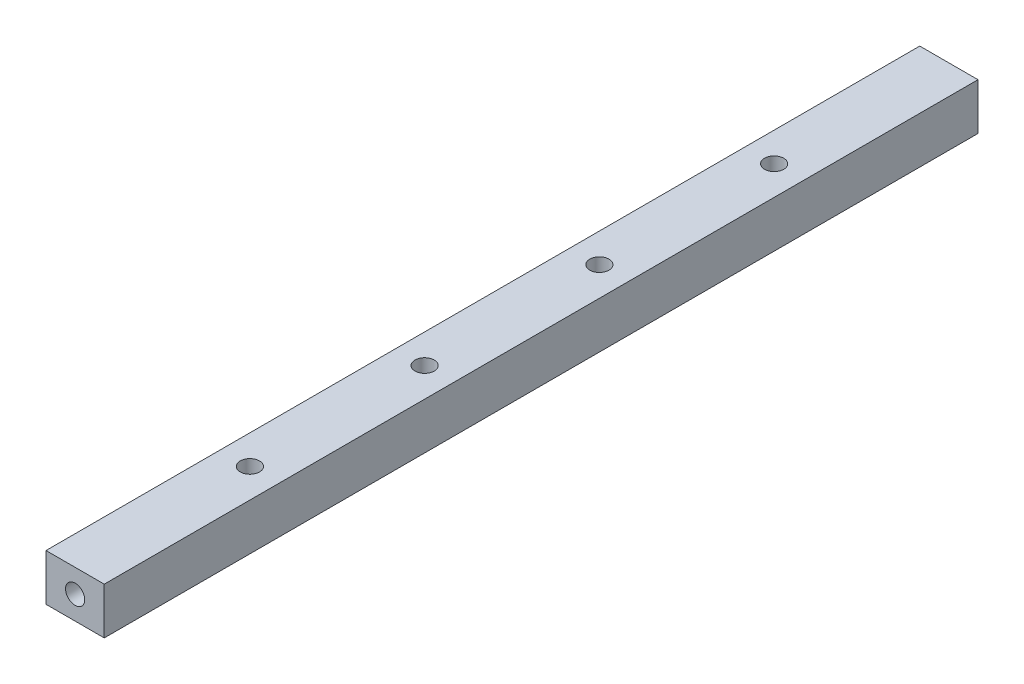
ISO-10303-21;
HEADER;
FILE_DESCRIPTION(('STEP AP214'),'2;1');
FILE_NAME('part.step','',(''),(''),'','','');
FILE_SCHEMA(('AUTOMOTIVE_DESIGN { 1 0 10303 214 1 1 1 1 }'));
ENDSEC;
DATA;
#1=APPLICATION_CONTEXT('core data for automotive mechanical design processes');
#2=APPLICATION_PROTOCOL_DEFINITION('international standard','automotive_design',2000,#1);
#3=PRODUCT_CONTEXT('',#1,'mechanical');
#4=PRODUCT('Part','Part','',(#3));
#5=PRODUCT_RELATED_PRODUCT_CATEGORY('part','',(#4));
#6=PRODUCT_DEFINITION_FORMATION('','',#4);
#7=PRODUCT_DEFINITION_CONTEXT('part definition',#1,'design');
#8=PRODUCT_DEFINITION('design','',#6,#7);
#9=PRODUCT_DEFINITION_SHAPE('','',#8);
#10=(LENGTH_UNIT() NAMED_UNIT(*) SI_UNIT(.MILLI.,.METRE.));
#11=(NAMED_UNIT(*) PLANE_ANGLE_UNIT() SI_UNIT($,.RADIAN.));
#12=(NAMED_UNIT(*) SI_UNIT($,.STERADIAN.) SOLID_ANGLE_UNIT());
#13=UNCERTAINTY_MEASURE_WITH_UNIT(LENGTH_MEASURE(1.E-05),#10,'distance_accuracy_value','');
#14=(GEOMETRIC_REPRESENTATION_CONTEXT(3) GLOBAL_UNCERTAINTY_ASSIGNED_CONTEXT((#13)) GLOBAL_UNIT_ASSIGNED_CONTEXT((#10,
#11,#12)) REPRESENTATION_CONTEXT('',''));
#15=CARTESIAN_POINT('',(0.,0.,0.));
#16=DIRECTION('',(0.,0.,1.));
#17=DIRECTION('',(1.,0.,0.));
#18=AXIS2_PLACEMENT_3D('',#15,#16,#17);
#19=CARTESIAN_POINT('',(-5.,4.,150.));
#20=DIRECTION('',(1.,0.,0.));
#21=DIRECTION('',(0.,0.,-1.));
#22=AXIS2_PLACEMENT_3D('',#19,#20,#21);
#23=PLANE('',#22);
#24=DIRECTION('',(0.,-1.,0.));
#25=VECTOR('',#24,1.);
#26=CARTESIAN_POINT('',(-5.,4.,0.));
#27=LINE('',#26,#25);
#28=CARTESIAN_POINT('',(-5.,4.,0.));
#29=VERTEX_POINT('',#28);
#30=CARTESIAN_POINT('',(-5.,-4.,0.));
#31=VERTEX_POINT('',#30);
#32=EDGE_CURVE('E95',#29,#31,#27,.T.);
#33=ORIENTED_EDGE('',*,*,#32,.T.);
#34=DIRECTION('',(0.,0.,-1.));
#35=VECTOR('',#34,1.);
#36=CARTESIAN_POINT('',(-5.,-4.,150.));
#37=LINE('',#36,#35);
#38=CARTESIAN_POINT('',(-5.,-4.,150.));
#39=VERTEX_POINT('',#38);
#40=EDGE_CURVE('E121',#39,#31,#37,.T.);
#41=ORIENTED_EDGE('',*,*,#40,.F.);
#42=DIRECTION('',(0.,-1.,0.));
#43=VECTOR('',#42,1.);
#44=CARTESIAN_POINT('',(-5.,4.,150.));
#45=LINE('',#44,#43);
#46=CARTESIAN_POINT('',(-5.,4.,150.));
#47=VERTEX_POINT('',#46);
#48=EDGE_CURVE('E106',#47,#39,#45,.T.);
#49=ORIENTED_EDGE('',*,*,#48,.F.);
#50=DIRECTION('',(0.,0.,-1.));
#51=VECTOR('',#50,1.);
#52=CARTESIAN_POINT('',(-5.,4.,150.));
#53=LINE('',#52,#51);
#54=EDGE_CURVE('E111',#47,#29,#53,.T.);
#55=ORIENTED_EDGE('',*,*,#54,.T.);
#56=EDGE_LOOP('',(#33,#41,#49,#55));
#57=FACE_BOUND('',#56,.T.);
#58=ADVANCED_FACE('F32',(#57),#23,.F.);
#59=CARTESIAN_POINT('',(-5.,-4.,150.));
#60=DIRECTION('',(0.,1.,0.));
#61=DIRECTION('',(0.,0.,1.));
#62=AXIS2_PLACEMENT_3D('',#59,#60,#61);
#63=PLANE('',#62);
#64=CARTESIAN_POINT('',(0.,-4.,60.));
#65=DIRECTION('',(0.,1.,0.));
#66=DIRECTION('',(0.,0.,1.));
#67=AXIS2_PLACEMENT_3D('',#64,#65,#66);
#68=CIRCLE('',#67,1.65);
#69=CARTESIAN_POINT('',(0.,-4.,61.65));
#70=VERTEX_POINT('',#69);
#71=EDGE_CURVE('E258',#70,#70,#68,.T.);
#72=ORIENTED_EDGE('',*,*,#71,.T.);
#73=EDGE_LOOP('',(#72));
#74=FACE_BOUND('',#73,.T.);
#75=CARTESIAN_POINT('',(0.,-4.,30.));
#76=DIRECTION('',(0.,1.,0.));
#77=DIRECTION('',(0.,0.,1.));
#78=AXIS2_PLACEMENT_3D('',#75,#76,#77);
#79=CIRCLE('',#78,1.65);
#80=CARTESIAN_POINT('',(0.,-4.,31.65));
#81=VERTEX_POINT('',#80);
#82=EDGE_CURVE('E102',#81,#81,#79,.T.);
#83=ORIENTED_EDGE('',*,*,#82,.T.);
#84=EDGE_LOOP('',(#83));
#85=FACE_BOUND('',#84,.T.);
#86=DIRECTION('',(1.,0.,0.));
#87=VECTOR('',#86,1.);
#88=CARTESIAN_POINT('',(-5.,-4.,0.));
#89=LINE('',#88,#87);
#90=CARTESIAN_POINT('',(5.,-4.,0.));
#91=VERTEX_POINT('',#90);
#92=EDGE_CURVE('E99',#31,#91,#89,.T.);
#93=ORIENTED_EDGE('',*,*,#92,.T.);
#94=DIRECTION('',(0.,0.,-1.));
#95=VECTOR('',#94,1.);
#96=CARTESIAN_POINT('',(5.,-4.,150.));
#97=LINE('',#96,#95);
#98=CARTESIAN_POINT('',(5.,-4.,150.));
#99=VERTEX_POINT('',#98);
#100=EDGE_CURVE('E119',#99,#91,#97,.T.);
#101=ORIENTED_EDGE('',*,*,#100,.F.);
#102=DIRECTION('',(1.,0.,0.));
#103=VECTOR('',#102,1.);
#104=CARTESIAN_POINT('',(-5.,-4.,150.));
#105=LINE('',#104,#103);
#106=EDGE_CURVE('E81',#39,#99,#105,.T.);
#107=ORIENTED_EDGE('',*,*,#106,.F.);
#108=ORIENTED_EDGE('',*,*,#40,.T.);
#109=EDGE_LOOP('',(#93,#101,#107,#108));
#110=FACE_BOUND('',#109,.T.);
#111=CARTESIAN_POINT('',(0.,-4.,90.));
#112=DIRECTION('',(0.,1.,0.));
#113=DIRECTION('',(0.,0.,1.));
#114=AXIS2_PLACEMENT_3D('',#111,#112,#113);
#115=CIRCLE('',#114,1.65);
#116=CARTESIAN_POINT('',(0.,-4.,91.65));
#117=VERTEX_POINT('',#116);
#118=EDGE_CURVE('E123',#117,#117,#115,.T.);
#119=ORIENTED_EDGE('',*,*,#118,.T.);
#120=EDGE_LOOP('',(#119));
#121=FACE_BOUND('',#120,.T.);
#122=CARTESIAN_POINT('',(0.,-4.,120.));
#123=DIRECTION('',(0.,1.,0.));
#124=DIRECTION('',(0.,0.,1.));
#125=AXIS2_PLACEMENT_3D('',#122,#123,#124);
#126=CIRCLE('',#125,1.65);
#127=CARTESIAN_POINT('',(0.,-4.,121.65));
#128=VERTEX_POINT('',#127);
#129=EDGE_CURVE('E41',#128,#128,#126,.T.);
#130=ORIENTED_EDGE('',*,*,#129,.T.);
#131=EDGE_LOOP('',(#130));
#132=FACE_BOUND('',#131,.T.);
#133=ADVANCED_FACE('F131',(#74,#85,#110,#121,#132),#63,.F.);
#134=CARTESIAN_POINT('',(5.,4.,150.));
#135=DIRECTION('',(-1.,0.,0.));
#136=DIRECTION('',(0.,-1.,0.));
#137=AXIS2_PLACEMENT_3D('',#134,#135,#136);
#138=PLANE('',#137);
#139=DIRECTION('',(0.,1.,0.));
#140=VECTOR('',#139,1.);
#141=CARTESIAN_POINT('',(5.,4.,0.));
#142=LINE('',#141,#140);
#143=CARTESIAN_POINT('',(5.,4.,0.));
#144=VERTEX_POINT('',#143);
#145=EDGE_CURVE('E67',#91,#144,#142,.T.);
#146=ORIENTED_EDGE('',*,*,#145,.T.);
#147=DIRECTION('',(0.,0.,-1.));
#148=VECTOR('',#147,1.);
#149=CARTESIAN_POINT('',(5.,4.,150.));
#150=LINE('',#149,#148);
#151=CARTESIAN_POINT('',(5.,4.,150.));
#152=VERTEX_POINT('',#151);
#153=EDGE_CURVE('E117',#152,#144,#150,.T.);
#154=ORIENTED_EDGE('',*,*,#153,.F.);
#155=DIRECTION('',(0.,1.,0.));
#156=VECTOR('',#155,1.);
#157=CARTESIAN_POINT('',(5.,4.,150.));
#158=LINE('',#157,#156);
#159=EDGE_CURVE('E109',#99,#152,#158,.T.);
#160=ORIENTED_EDGE('',*,*,#159,.F.);
#161=ORIENTED_EDGE('',*,*,#100,.T.);
#162=EDGE_LOOP('',(#146,#154,#160,#161));
#163=FACE_BOUND('',#162,.T.);
#164=ADVANCED_FACE('F141',(#163),#138,.F.);
#165=CARTESIAN_POINT('',(-5.,4.,150.));
#166=DIRECTION('',(0.,-1.,0.));
#167=DIRECTION('',(0.,0.,-1.));
#168=AXIS2_PLACEMENT_3D('',#165,#166,#167);
#169=PLANE('',#168);
#170=CARTESIAN_POINT('',(0.,4.,60.));
#171=DIRECTION('',(0.,1.,0.));
#172=DIRECTION('',(0.,0.,1.));
#173=AXIS2_PLACEMENT_3D('',#170,#171,#172);
#174=CIRCLE('',#173,1.64999999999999);
#175=CARTESIAN_POINT('',(0.,4.,61.65));
#176=VERTEX_POINT('',#175);
#177=EDGE_CURVE('E260',#176,#176,#174,.T.);
#178=ORIENTED_EDGE('',*,*,#177,.F.);
#179=EDGE_LOOP('',(#178));
#180=FACE_BOUND('',#179,.T.);
#181=CARTESIAN_POINT('',(0.,4.,30.));
#182=DIRECTION('',(0.,1.,0.));
#183=DIRECTION('',(0.,0.,1.));
#184=AXIS2_PLACEMENT_3D('',#181,#182,#183);
#185=CIRCLE('',#184,1.64999999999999);
#186=CARTESIAN_POINT('',(0.,4.,31.65));
#187=VERTEX_POINT('',#186);
#188=EDGE_CURVE('E261',#187,#187,#185,.T.);
#189=ORIENTED_EDGE('',*,*,#188,.F.);
#190=EDGE_LOOP('',(#189));
#191=FACE_BOUND('',#190,.T.);
#192=DIRECTION('',(-1.,0.,0.));
#193=VECTOR('',#192,1.);
#194=CARTESIAN_POINT('',(-5.,4.,0.));
#195=LINE('',#194,#193);
#196=EDGE_CURVE('E73',#144,#29,#195,.T.);
#197=ORIENTED_EDGE('',*,*,#196,.T.);
#198=ORIENTED_EDGE('',*,*,#54,.F.);
#199=DIRECTION('',(-1.,0.,0.));
#200=VECTOR('',#199,1.);
#201=CARTESIAN_POINT('',(-5.,4.,150.));
#202=LINE('',#201,#200);
#203=EDGE_CURVE('E49',#152,#47,#202,.T.);
#204=ORIENTED_EDGE('',*,*,#203,.F.);
#205=ORIENTED_EDGE('',*,*,#153,.T.);
#206=EDGE_LOOP('',(#197,#198,#204,#205));
#207=FACE_BOUND('',#206,.T.);
#208=CARTESIAN_POINT('',(0.,4.,90.));
#209=DIRECTION('',(0.,1.,0.));
#210=DIRECTION('',(0.,0.,1.));
#211=AXIS2_PLACEMENT_3D('',#208,#209,#210);
#212=CIRCLE('',#211,1.64999999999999);
#213=CARTESIAN_POINT('',(0.,4.,91.65));
#214=VERTEX_POINT('',#213);
#215=EDGE_CURVE('E126',#214,#214,#212,.T.);
#216=ORIENTED_EDGE('',*,*,#215,.F.);
#217=EDGE_LOOP('',(#216));
#218=FACE_BOUND('',#217,.T.);
#219=CARTESIAN_POINT('',(0.,4.,120.));
#220=DIRECTION('',(0.,1.,0.));
#221=DIRECTION('',(0.,0.,1.));
#222=AXIS2_PLACEMENT_3D('',#219,#220,#221);
#223=CIRCLE('',#222,1.64999999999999);
#224=CARTESIAN_POINT('',(0.,4.,121.65));
#225=VERTEX_POINT('',#224);
#226=EDGE_CURVE('E11',#225,#225,#223,.T.);
#227=ORIENTED_EDGE('',*,*,#226,.F.);
#228=EDGE_LOOP('',(#227));
#229=FACE_BOUND('',#228,.T.);
#230=ADVANCED_FACE('F138',(#180,#191,#207,#218,#229),#169,.F.);
#231=CARTESIAN_POINT('',(-5.,-4.,150.));
#232=DIRECTION('',(0.,0.,1.));
#233=DIRECTION('',(1.,0.,0.));
#234=AXIS2_PLACEMENT_3D('',#231,#232,#233);
#235=PLANE('',#234);
#236=CARTESIAN_POINT('',(0.,0.,150.));
#237=DIRECTION('',(0.,0.,1.));
#238=DIRECTION('',(1.,0.,0.));
#239=AXIS2_PLACEMENT_3D('',#236,#237,#238);
#240=CIRCLE('',#239,1.64999999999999);
#241=CARTESIAN_POINT('',(1.64999999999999,0.,150.));
#242=VERTEX_POINT('',#241);
#243=EDGE_CURVE('E96',#242,#242,#240,.T.);
#244=ORIENTED_EDGE('',*,*,#243,.F.);
#245=EDGE_LOOP('',(#244));
#246=FACE_BOUND('',#245,.T.);
#247=ORIENTED_EDGE('',*,*,#48,.T.);
#248=ORIENTED_EDGE('',*,*,#106,.T.);
#249=ORIENTED_EDGE('',*,*,#159,.T.);
#250=ORIENTED_EDGE('',*,*,#203,.T.);
#251=EDGE_LOOP('',(#247,#248,#249,#250));
#252=FACE_BOUND('',#251,.T.);
#253=ADVANCED_FACE('F140',(#246,#252),#235,.T.);
#254=CARTESIAN_POINT('',(-5.,-4.,0.));
#255=DIRECTION('',(0.,0.,1.));
#256=DIRECTION('',(1.,0.,0.));
#257=AXIS2_PLACEMENT_3D('',#254,#255,#256);
#258=PLANE('',#257);
#259=ORIENTED_EDGE('',*,*,#32,.F.);
#260=ORIENTED_EDGE('',*,*,#196,.F.);
#261=ORIENTED_EDGE('',*,*,#145,.F.);
#262=ORIENTED_EDGE('',*,*,#92,.F.);
#263=EDGE_LOOP('',(#259,#260,#261,#262));
#264=FACE_BOUND('',#263,.T.);
#265=ADVANCED_FACE('F89',(#264),#258,.F.);
#266=CARTESIAN_POINT('',(0.,0.,130.));
#267=DIRECTION('',(0.,0.,1.));
#268=DIRECTION('',(1.,0.,0.));
#269=AXIS2_PLACEMENT_3D('',#266,#267,#268);
#270=CONICAL_SURFACE('',#269,1.64999999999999,1.02974425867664);
#271=CARTESIAN_POINT('',(0.,0.,129.008579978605));
#272=VERTEX_POINT('',#271);
#273=VERTEX_LOOP('',#272);
#274=FACE_BOUND('',#273,.T.);
#275=CARTESIAN_POINT('',(0.,0.,130.));
#276=DIRECTION('',(0.,0.,1.));
#277=DIRECTION('',(1.,0.,0.));
#278=AXIS2_PLACEMENT_3D('',#275,#276,#277);
#279=CIRCLE('',#278,1.64999999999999);
#280=CARTESIAN_POINT('',(1.64999999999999,0.,130.));
#281=VERTEX_POINT('',#280);
#282=EDGE_CURVE('E93',#281,#281,#279,.T.);
#283=ORIENTED_EDGE('',*,*,#282,.T.);
#284=EDGE_LOOP('',(#283));
#285=FACE_BOUND('',#284,.T.);
#286=ADVANCED_FACE('F85',(#274,#285),#270,.F.);
#287=CARTESIAN_POINT('',(0.,0.,150.));
#288=DIRECTION('',(0.,0.,1.));
#289=DIRECTION('',(1.,0.,0.));
#290=AXIS2_PLACEMENT_3D('',#287,#288,#289);
#291=CYLINDRICAL_SURFACE('',#290,1.64999999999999);
#292=ORIENTED_EDGE('',*,*,#282,.F.);
#293=EDGE_LOOP('',(#292));
#294=FACE_BOUND('',#293,.T.);
#295=ORIENTED_EDGE('',*,*,#243,.T.);
#296=EDGE_LOOP('',(#295));
#297=FACE_BOUND('',#296,.T.);
#298=ADVANCED_FACE('F88',(#294,#297),#291,.F.);
#299=CARTESIAN_POINT('',(0.,4.,30.));
#300=DIRECTION('',(0.,1.,0.));
#301=DIRECTION('',(0.,0.,1.));
#302=AXIS2_PLACEMENT_3D('',#299,#300,#301);
#303=CYLINDRICAL_SURFACE('',#302,1.64999999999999);
#304=ORIENTED_EDGE('',*,*,#82,.F.);
#305=EDGE_LOOP('',(#304));
#306=FACE_BOUND('',#305,.T.);
#307=ORIENTED_EDGE('',*,*,#188,.T.);
#308=EDGE_LOOP('',(#307));
#309=FACE_BOUND('',#308,.T.);
#310=ADVANCED_FACE('F168',(#306,#309),#303,.F.);
#311=CARTESIAN_POINT('',(0.,4.,60.));
#312=DIRECTION('',(0.,1.,0.));
#313=DIRECTION('',(0.,0.,1.));
#314=AXIS2_PLACEMENT_3D('',#311,#312,#313);
#315=CYLINDRICAL_SURFACE('',#314,1.64999999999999);
#316=ORIENTED_EDGE('',*,*,#71,.F.);
#317=EDGE_LOOP('',(#316));
#318=FACE_BOUND('',#317,.T.);
#319=ORIENTED_EDGE('',*,*,#177,.T.);
#320=EDGE_LOOP('',(#319));
#321=FACE_BOUND('',#320,.T.);
#322=ADVANCED_FACE('F163',(#318,#321),#315,.F.);
#323=CARTESIAN_POINT('',(0.,4.,90.));
#324=DIRECTION('',(0.,1.,0.));
#325=DIRECTION('',(0.,0.,1.));
#326=AXIS2_PLACEMENT_3D('',#323,#324,#325);
#327=CYLINDRICAL_SURFACE('',#326,1.64999999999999);
#328=ORIENTED_EDGE('',*,*,#118,.F.);
#329=EDGE_LOOP('',(#328));
#330=FACE_BOUND('',#329,.T.);
#331=ORIENTED_EDGE('',*,*,#215,.T.);
#332=EDGE_LOOP('',(#331));
#333=FACE_BOUND('',#332,.T.);
#334=ADVANCED_FACE('F135',(#330,#333),#327,.F.);
#335=CARTESIAN_POINT('',(0.,4.,120.));
#336=DIRECTION('',(0.,1.,0.));
#337=DIRECTION('',(0.,0.,1.));
#338=AXIS2_PLACEMENT_3D('',#335,#336,#337);
#339=CYLINDRICAL_SURFACE('',#338,1.64999999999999);
#340=ORIENTED_EDGE('',*,*,#129,.F.);
#341=EDGE_LOOP('',(#340));
#342=FACE_BOUND('',#341,.T.);
#343=ORIENTED_EDGE('',*,*,#226,.T.);
#344=EDGE_LOOP('',(#343));
#345=FACE_BOUND('',#344,.T.);
#346=ADVANCED_FACE('F34',(#342,#345),#339,.F.);
#347=CLOSED_SHELL('',(#58,#133,#164,#230,#253,#265,#286,#298,#310,#322,#334,#346));
#348=MANIFOLD_SOLID_BREP('B2',#347);
#349=ADVANCED_BREP_SHAPE_REPRESENTATION('',(#18,#348),#14);
#350=SHAPE_DEFINITION_REPRESENTATION(#9,#349);
ENDSEC;
END-ISO-10303-21;
